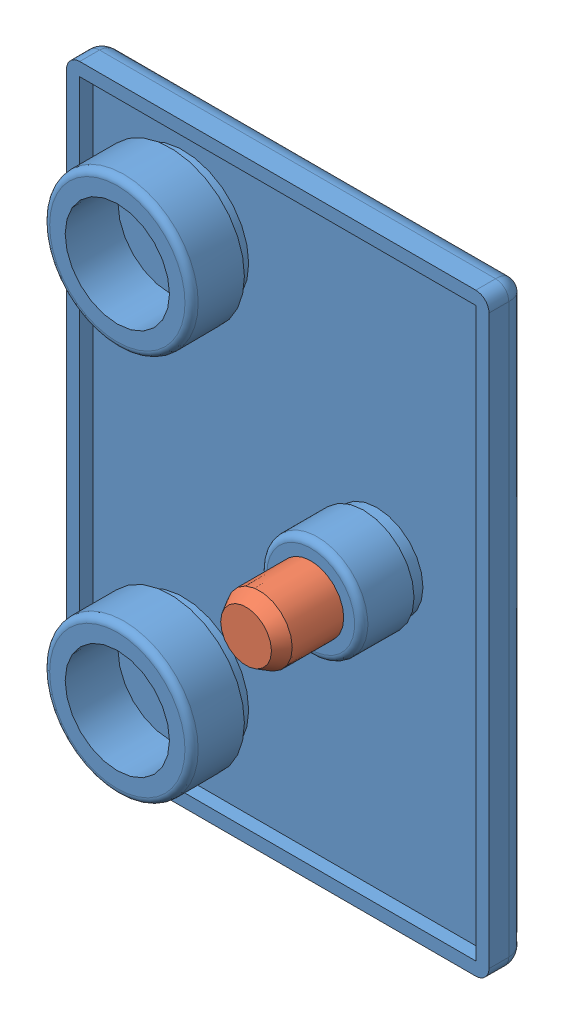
SolidWorks assembly 22.1003_1 END CAP 45X32 Z GRAY.SLDASM, configuration Default (file format 6000). Lengths in mm.
Overall size (32.01 45.01 11.9).
2 component instances, 2 part files, 2 mates.
Components (placement in the parent):
- 22.1003_1 END CAP 45X32 GRAY-1: 22.1003_1 END CAP 45X32 GRAY.SLDPRT [Default] at origin size (32.01 45.01 7.01)
- END CAP DOWEL GRAY-1: END CAP DOWEL GRAY.SLDPRT [Default] at (-226.2859 -77.9472 13) size (5 5 11.9)
Mates (geometry in assembly coordinates):
- Coincident1: coincident: axis of 22.1003_1 END CAP 45X32 GRAY-1 through (0 0 3) axis (0 0 1); axis of END CAP DOWEL GRAY-1 through (0 0 -59.6614) axis (0 0 1)
- Coincident3: coincident aligned: plane of 22.1003_1 END CAP 45X32 GRAY-1 through (-6.5 0 0) normal (0 0 -1); plane of END CAP DOWEL GRAY-1 through (0 0 0) normal (0 0 -1)
